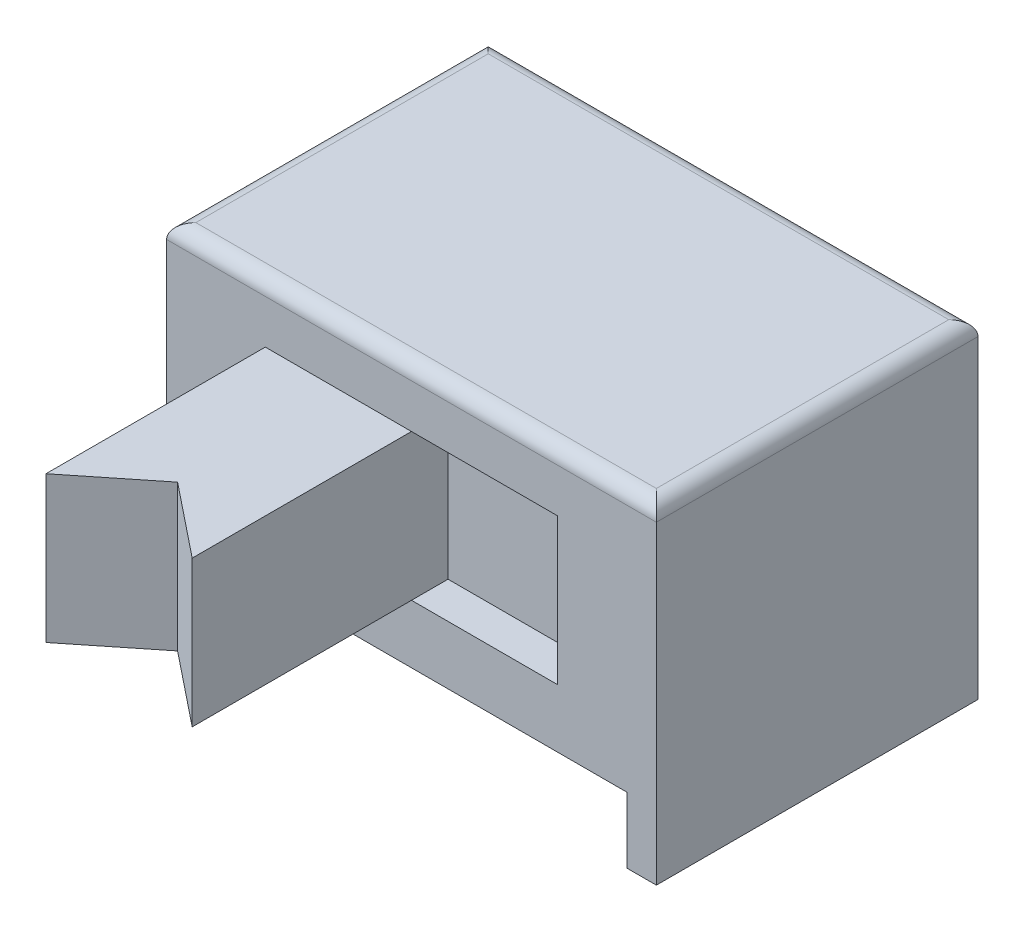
ISO-10303-21;
HEADER;
FILE_DESCRIPTION(('STEP AP214'),'2;1');
FILE_NAME('part.step','',(''),(''),'','','');
FILE_SCHEMA(('AUTOMOTIVE_DESIGN { 1 0 10303 214 1 1 1 1 }'));
ENDSEC;
DATA;
#1=APPLICATION_CONTEXT('core data for automotive mechanical design processes');
#2=APPLICATION_PROTOCOL_DEFINITION('international standard','automotive_design',2000,#1);
#3=PRODUCT_CONTEXT('',#1,'mechanical');
#4=PRODUCT('Part','Part','',(#3));
#5=PRODUCT_RELATED_PRODUCT_CATEGORY('part','',(#4));
#6=PRODUCT_DEFINITION_FORMATION('','',#4);
#7=PRODUCT_DEFINITION_CONTEXT('part definition',#1,'design');
#8=PRODUCT_DEFINITION('design','',#6,#7);
#9=PRODUCT_DEFINITION_SHAPE('','',#8);
#10=(LENGTH_UNIT() NAMED_UNIT(*) SI_UNIT(.MILLI.,.METRE.));
#11=(NAMED_UNIT(*) PLANE_ANGLE_UNIT() SI_UNIT($,.RADIAN.));
#12=(NAMED_UNIT(*) SI_UNIT($,.STERADIAN.) SOLID_ANGLE_UNIT());
#13=UNCERTAINTY_MEASURE_WITH_UNIT(LENGTH_MEASURE(1.E-05),#10,'distance_accuracy_value','');
#14=(GEOMETRIC_REPRESENTATION_CONTEXT(3) GLOBAL_UNCERTAINTY_ASSIGNED_CONTEXT((#13)) GLOBAL_UNIT_ASSIGNED_CONTEXT((#10,
#11,#12)) REPRESENTATION_CONTEXT('',''));
#15=CARTESIAN_POINT('',(0.,0.,0.));
#16=DIRECTION('',(0.,0.,1.));
#17=DIRECTION('',(1.,0.,0.));
#18=AXIS2_PLACEMENT_3D('',#15,#16,#17);
#19=CARTESIAN_POINT('',(0.,0.,-4.4));
#20=DIRECTION('',(0.,-1.,0.));
#21=DIRECTION('',(0.,0.,-1.));
#22=AXIS2_PLACEMENT_3D('',#19,#20,#21);
#23=PLANE('',#22);
#24=DIRECTION('',(0.,0.,1.));
#25=VECTOR('',#24,1.);
#26=CARTESIAN_POINT('',(0.4,0.,-4.4));
#27=LINE('',#26,#25);
#28=CARTESIAN_POINT('',(0.4,0.,-4.4));
#29=VERTEX_POINT('',#28);
#30=CARTESIAN_POINT('',(0.4,0.,0.));
#31=VERTEX_POINT('',#30);
#32=EDGE_CURVE('E155',#29,#31,#27,.T.);
#33=ORIENTED_EDGE('',*,*,#32,.T.);
#34=DIRECTION('',(1.,0.,0.));
#35=VECTOR('',#34,1.);
#36=CARTESIAN_POINT('',(0.,0.,0.));
#37=LINE('',#36,#35);
#38=CARTESIAN_POINT('',(0.,0.,0.));
#39=VERTEX_POINT('',#38);
#40=EDGE_CURVE('E168',#39,#31,#37,.T.);
#41=ORIENTED_EDGE('',*,*,#40,.F.);
#42=DIRECTION('',(0.,0.,1.));
#43=VECTOR('',#42,1.);
#44=CARTESIAN_POINT('',(0.,0.,0.));
#45=LINE('',#44,#43);
#46=CARTESIAN_POINT('',(0.,0.,-4.4));
#47=VERTEX_POINT('',#46);
#48=EDGE_CURVE('E181',#47,#39,#45,.T.);
#49=ORIENTED_EDGE('',*,*,#48,.F.);
#50=DIRECTION('',(-1.,0.,0.));
#51=VECTOR('',#50,1.);
#52=CARTESIAN_POINT('',(0.,0.,-4.4));
#53=LINE('',#52,#51);
#54=EDGE_CURVE('E170',#29,#47,#53,.T.);
#55=ORIENTED_EDGE('',*,*,#54,.F.);
#56=EDGE_LOOP('',(#33,#41,#49,#55));
#57=FACE_BOUND('',#56,.T.);
#58=ADVANCED_FACE('F26',(#57),#23,.T.);
#59=CARTESIAN_POINT('',(1.35,3.7,-0.5));
#60=DIRECTION('',(0.,1.,0.));
#61=DIRECTION('',(-1.,0.,0.));
#62=AXIS2_PLACEMENT_3D('',#59,#60,#61);
#63=PLANE('',#62);
#64=DIRECTION('',(0.,0.,-1.));
#65=VECTOR('',#64,1.);
#66=CARTESIAN_POINT('',(3.35,3.7,3.));
#67=LINE('',#66,#65);
#68=CARTESIAN_POINT('',(3.35,3.7,0.));
#69=VERTEX_POINT('',#68);
#70=CARTESIAN_POINT('',(3.35,3.7,-0.5));
#71=VERTEX_POINT('',#70);
#72=EDGE_CURVE('E265',#69,#71,#67,.T.);
#73=ORIENTED_EDGE('',*,*,#72,.T.);
#74=DIRECTION('',(-1.,0.,0.));
#75=VECTOR('',#74,1.);
#76=CARTESIAN_POINT('',(1.35,3.7,-0.5));
#77=LINE('',#76,#75);
#78=CARTESIAN_POINT('',(5.35,3.7,-0.5));
#79=VERTEX_POINT('',#78);
#80=EDGE_CURVE('E294',#79,#71,#77,.T.);
#81=ORIENTED_EDGE('',*,*,#80,.F.);
#82=DIRECTION('',(0.,0.,1.));
#83=VECTOR('',#82,1.);
#84=CARTESIAN_POINT('',(5.35,3.7,-0.5));
#85=LINE('',#84,#83);
#86=CARTESIAN_POINT('',(5.35,3.7,0.));
#87=VERTEX_POINT('',#86);
#88=EDGE_CURVE('E298',#79,#87,#85,.T.);
#89=ORIENTED_EDGE('',*,*,#88,.T.);
#90=DIRECTION('',(-1.,0.,0.));
#91=VECTOR('',#90,1.);
#92=CARTESIAN_POINT('',(1.35,3.7,0.));
#93=LINE('',#92,#91);
#94=EDGE_CURVE('E286',#87,#69,#93,.T.);
#95=ORIENTED_EDGE('',*,*,#94,.T.);
#96=EDGE_LOOP('',(#73,#81,#89,#95));
#97=FACE_BOUND('',#96,.T.);
#98=ADVANCED_FACE('F315',(#97),#63,.F.);
#99=CARTESIAN_POINT('',(1.35,1.7,-0.5));
#100=DIRECTION('',(0.,-1.,0.));
#101=DIRECTION('',(1.,0.,0.));
#102=AXIS2_PLACEMENT_3D('',#99,#100,#101);
#103=PLANE('',#102);
#104=DIRECTION('',(0.,0.,-1.));
#105=VECTOR('',#104,1.);
#106=CARTESIAN_POINT('',(3.35,1.7,3.));
#107=LINE('',#106,#105);
#108=CARTESIAN_POINT('',(3.35,1.7,0.));
#109=VERTEX_POINT('',#108);
#110=CARTESIAN_POINT('',(3.35,1.7,-0.5));
#111=VERTEX_POINT('',#110);
#112=EDGE_CURVE('E269',#109,#111,#107,.T.);
#113=ORIENTED_EDGE('',*,*,#112,.F.);
#114=DIRECTION('',(1.,0.,0.));
#115=VECTOR('',#114,1.);
#116=CARTESIAN_POINT('',(1.35,1.7,0.));
#117=LINE('',#116,#115);
#118=CARTESIAN_POINT('',(5.35,1.7,0.));
#119=VERTEX_POINT('',#118);
#120=EDGE_CURVE('E280',#109,#119,#117,.T.);
#121=ORIENTED_EDGE('',*,*,#120,.T.);
#122=DIRECTION('',(0.,0.,1.));
#123=VECTOR('',#122,1.);
#124=CARTESIAN_POINT('',(5.35,1.7,-0.5));
#125=LINE('',#124,#123);
#126=CARTESIAN_POINT('',(5.35,1.7,-0.5));
#127=VERTEX_POINT('',#126);
#128=EDGE_CURVE('E297',#127,#119,#125,.T.);
#129=ORIENTED_EDGE('',*,*,#128,.F.);
#130=DIRECTION('',(1.,0.,0.));
#131=VECTOR('',#130,1.);
#132=CARTESIAN_POINT('',(1.35,1.7,-0.5));
#133=LINE('',#132,#131);
#134=EDGE_CURVE('E289',#111,#127,#133,.T.);
#135=ORIENTED_EDGE('',*,*,#134,.F.);
#136=EDGE_LOOP('',(#113,#121,#129,#135));
#137=FACE_BOUND('',#136,.T.);
#138=ADVANCED_FACE('F321',(#137),#103,.F.);
#139=CARTESIAN_POINT('',(1.35,3.7,-0.5));
#140=DIRECTION('',(0.,0.,1.));
#141=DIRECTION('',(1.,0.,0.));
#142=AXIS2_PLACEMENT_3D('',#139,#140,#141);
#143=PLANE('',#142);
#144=ORIENTED_EDGE('',*,*,#80,.T.);
#145=DIRECTION('',(0.,1.,0.));
#146=VECTOR('',#145,1.);
#147=CARTESIAN_POINT('',(3.35,3.7,-0.5));
#148=LINE('',#147,#146);
#149=EDGE_CURVE('E256',#111,#71,#148,.T.);
#150=ORIENTED_EDGE('',*,*,#149,.F.);
#151=ORIENTED_EDGE('',*,*,#134,.T.);
#152=DIRECTION('',(0.,1.,0.));
#153=VECTOR('',#152,1.);
#154=CARTESIAN_POINT('',(5.35,3.7,-0.5));
#155=LINE('',#154,#153);
#156=EDGE_CURVE('E291',#127,#79,#155,.T.);
#157=ORIENTED_EDGE('',*,*,#156,.T.);
#158=EDGE_LOOP('',(#144,#150,#151,#157));
#159=FACE_BOUND('',#158,.T.);
#160=ADVANCED_FACE('F318',(#159),#143,.T.);
#161=CARTESIAN_POINT('',(0.,4.5,0.));
#162=DIRECTION('',(1.,0.,0.));
#163=DIRECTION('',(0.,0.,-1.));
#164=AXIS2_PLACEMENT_3D('',#161,#162,#163);
#165=PLANE('',#164);
#166=DIRECTION('',(0.,-1.,0.));
#167=VECTOR('',#166,1.);
#168=CARTESIAN_POINT('',(0.,4.5,0.));
#169=LINE('',#168,#167);
#170=CARTESIAN_POINT('',(0.,4.3,0.));
#171=VERTEX_POINT('',#170);
#172=EDGE_CURVE('E175',#171,#39,#169,.T.);
#173=ORIENTED_EDGE('',*,*,#172,.F.);
#174=DIRECTION('',(0.,0.,1.));
#175=VECTOR('',#174,1.);
#176=CARTESIAN_POINT('',(0.,4.3,0.));
#177=LINE('',#176,#175);
#178=CARTESIAN_POINT('',(0.,4.3,-4.4));
#179=VERTEX_POINT('',#178);
#180=EDGE_CURVE('E49',#171,#179,#177,.F.);
#181=ORIENTED_EDGE('',*,*,#180,.T.);
#182=DIRECTION('',(0.,-1.,0.));
#183=VECTOR('',#182,1.);
#184=CARTESIAN_POINT('',(0.,4.5,-4.4));
#185=LINE('',#184,#183);
#186=EDGE_CURVE('E188',#179,#47,#185,.T.);
#187=ORIENTED_EDGE('',*,*,#186,.T.);
#188=ORIENTED_EDGE('',*,*,#48,.T.);
#189=EDGE_LOOP('',(#173,#181,#187,#188));
#190=FACE_BOUND('',#189,.T.);
#191=ADVANCED_FACE('F28',(#190),#165,.F.);
#192=CARTESIAN_POINT('',(0.,4.5,0.));
#193=DIRECTION('',(0.,0.,-1.));
#194=DIRECTION('',(-1.,0.,0.));
#195=AXIS2_PLACEMENT_3D('',#192,#193,#194);
#196=PLANE('',#195);
#197=CARTESIAN_POINT('',(1.35,1.7,0.));
#198=VERTEX_POINT('',#197);
#199=EDGE_CURVE('E281',#198,#109,#117,.T.);
#200=ORIENTED_EDGE('',*,*,#199,.F.);
#201=DIRECTION('',(0.,-1.,0.));
#202=VECTOR('',#201,1.);
#203=CARTESIAN_POINT('',(1.35,3.7,0.));
#204=LINE('',#203,#202);
#205=CARTESIAN_POINT('',(1.35,3.7,0.));
#206=VERTEX_POINT('',#205);
#207=EDGE_CURVE('E278',#206,#198,#204,.T.);
#208=ORIENTED_EDGE('',*,*,#207,.F.);
#209=DIRECTION('',(-1.,0.,0.));
#210=VECTOR('',#209,1.);
#211=CARTESIAN_POINT('',(0.,3.7,0.));
#212=LINE('',#211,#210);
#213=EDGE_CURVE('E276',#69,#206,#212,.T.);
#214=ORIENTED_EDGE('',*,*,#213,.F.);
#215=ORIENTED_EDGE('',*,*,#94,.F.);
#216=DIRECTION('',(0.,1.,0.));
#217=VECTOR('',#216,1.);
#218=CARTESIAN_POINT('',(5.35,3.7,0.));
#219=LINE('',#218,#217);
#220=EDGE_CURVE('E283',#119,#87,#219,.T.);
#221=ORIENTED_EDGE('',*,*,#220,.F.);
#222=ORIENTED_EDGE('',*,*,#120,.F.);
#223=EDGE_LOOP('',(#200,#208,#214,#215,#221,#222));
#224=FACE_BOUND('',#223,.T.);
#225=ORIENTED_EDGE('',*,*,#40,.T.);
#226=DIRECTION('',(0.,-1.,0.));
#227=VECTOR('',#226,1.);
#228=CARTESIAN_POINT('',(0.4,0.,0.));
#229=LINE('',#228,#227);
#230=CARTESIAN_POINT('',(0.4,0.9,0.));
#231=VERTEX_POINT('',#230);
#232=EDGE_CURVE('E151',#231,#31,#229,.T.);
#233=ORIENTED_EDGE('',*,*,#232,.F.);
#234=DIRECTION('',(-1.,0.,0.));
#235=VECTOR('',#234,1.);
#236=CARTESIAN_POINT('',(0.4,0.9,0.));
#237=LINE('',#236,#235);
#238=CARTESIAN_POINT('',(6.3,0.9,0.));
#239=VERTEX_POINT('',#238);
#240=EDGE_CURVE('E382',#239,#231,#237,.T.);
#241=ORIENTED_EDGE('',*,*,#240,.F.);
#242=DIRECTION('',(0.,1.,0.));
#243=VECTOR('',#242,1.);
#244=CARTESIAN_POINT('',(6.3,0.,0.));
#245=LINE('',#244,#243);
#246=CARTESIAN_POINT('',(6.3,0.,0.));
#247=VERTEX_POINT('',#246);
#248=EDGE_CURVE('E162',#247,#239,#245,.T.);
#249=ORIENTED_EDGE('',*,*,#248,.F.);
#250=CARTESIAN_POINT('',(6.7,0.,0.));
#251=VERTEX_POINT('',#250);
#252=EDGE_CURVE('E177',#247,#251,#37,.T.);
#253=ORIENTED_EDGE('',*,*,#252,.T.);
#254=DIRECTION('',(0.,-1.,0.));
#255=VECTOR('',#254,1.);
#256=CARTESIAN_POINT('',(6.7,4.5,0.));
#257=LINE('',#256,#255);
#258=CARTESIAN_POINT('',(6.7,4.3,0.));
#259=VERTEX_POINT('',#258);
#260=EDGE_CURVE('E192',#259,#251,#257,.T.);
#261=ORIENTED_EDGE('',*,*,#260,.F.);
#262=DIRECTION('',(1.,0.,0.));
#263=VECTOR('',#262,1.);
#264=CARTESIAN_POINT('',(0.,4.3,0.));
#265=LINE('',#264,#263);
#266=EDGE_CURVE('E11',#259,#171,#265,.F.);
#267=ORIENTED_EDGE('',*,*,#266,.T.);
#268=ORIENTED_EDGE('',*,*,#172,.T.);
#269=EDGE_LOOP('',(#225,#233,#241,#249,#253,#261,#267,#268));
#270=FACE_BOUND('',#269,.T.);
#271=ADVANCED_FACE('F174',(#224,#270),#196,.F.);
#272=CARTESIAN_POINT('',(6.7,4.5,0.));
#273=DIRECTION('',(-1.,0.,0.));
#274=DIRECTION('',(0.,0.,1.));
#275=AXIS2_PLACEMENT_3D('',#272,#273,#274);
#276=PLANE('',#275);
#277=DIRECTION('',(0.,-1.,0.));
#278=VECTOR('',#277,1.);
#279=CARTESIAN_POINT('',(6.7,4.5,-4.4));
#280=LINE('',#279,#278);
#281=CARTESIAN_POINT('',(6.7,4.3,-4.4));
#282=VERTEX_POINT('',#281);
#283=CARTESIAN_POINT('',(6.7,0.,-4.4));
#284=VERTEX_POINT('',#283);
#285=EDGE_CURVE('E190',#282,#284,#280,.T.);
#286=ORIENTED_EDGE('',*,*,#285,.F.);
#287=DIRECTION('',(0.,0.,-1.));
#288=VECTOR('',#287,1.);
#289=CARTESIAN_POINT('',(6.7,4.3,0.));
#290=LINE('',#289,#288);
#291=EDGE_CURVE('E205',#282,#259,#290,.F.);
#292=ORIENTED_EDGE('',*,*,#291,.T.);
#293=ORIENTED_EDGE('',*,*,#260,.T.);
#294=DIRECTION('',(0.,0.,-1.));
#295=VECTOR('',#294,1.);
#296=CARTESIAN_POINT('',(6.7,0.,0.));
#297=LINE('',#296,#295);
#298=EDGE_CURVE('E176',#251,#284,#297,.T.);
#299=ORIENTED_EDGE('',*,*,#298,.T.);
#300=EDGE_LOOP('',(#286,#292,#293,#299));
#301=FACE_BOUND('',#300,.T.);
#302=ADVANCED_FACE('F219',(#301),#276,.F.);
#303=CARTESIAN_POINT('',(0.,4.5,-4.4));
#304=DIRECTION('',(0.,0.,1.));
#305=DIRECTION('',(1.,0.,0.));
#306=AXIS2_PLACEMENT_3D('',#303,#304,#305);
#307=PLANE('',#306);
#308=DIRECTION('',(-1.,0.,0.));
#309=VECTOR('',#308,1.);
#310=CARTESIAN_POINT('',(0.4,0.9,-4.4));
#311=LINE('',#310,#309);
#312=CARTESIAN_POINT('',(6.3,0.9,-4.4));
#313=VERTEX_POINT('',#312);
#314=CARTESIAN_POINT('',(0.4,0.9,-4.4));
#315=VERTEX_POINT('',#314);
#316=EDGE_CURVE('E172',#313,#315,#311,.T.);
#317=ORIENTED_EDGE('',*,*,#316,.T.);
#318=DIRECTION('',(0.,-1.,0.));
#319=VECTOR('',#318,1.);
#320=CARTESIAN_POINT('',(0.4,0.,-4.4));
#321=LINE('',#320,#319);
#322=EDGE_CURVE('E379',#315,#29,#321,.T.);
#323=ORIENTED_EDGE('',*,*,#322,.T.);
#324=ORIENTED_EDGE('',*,*,#54,.T.);
#325=ORIENTED_EDGE('',*,*,#186,.F.);
#326=DIRECTION('',(-1.,0.,0.));
#327=VECTOR('',#326,1.);
#328=CARTESIAN_POINT('',(0.,4.3,-4.4));
#329=LINE('',#328,#327);
#330=EDGE_CURVE('E34',#179,#282,#329,.F.);
#331=ORIENTED_EDGE('',*,*,#330,.T.);
#332=ORIENTED_EDGE('',*,*,#285,.T.);
#333=CARTESIAN_POINT('',(6.3,0.,-4.4));
#334=VERTEX_POINT('',#333);
#335=EDGE_CURVE('E185',#284,#334,#53,.T.);
#336=ORIENTED_EDGE('',*,*,#335,.T.);
#337=DIRECTION('',(0.,1.,0.));
#338=VECTOR('',#337,1.);
#339=CARTESIAN_POINT('',(6.3,0.,-4.4));
#340=LINE('',#339,#338);
#341=EDGE_CURVE('E41',#334,#313,#340,.T.);
#342=ORIENTED_EDGE('',*,*,#341,.T.);
#343=EDGE_LOOP('',(#317,#323,#324,#325,#331,#332,#336,#342));
#344=FACE_BOUND('',#343,.T.);
#345=ADVANCED_FACE('F212',(#344),#307,.F.);
#346=CARTESIAN_POINT('',(0.,4.5,-4.4));
#347=DIRECTION('',(0.,-1.,0.));
#348=DIRECTION('',(0.,0.,-1.));
#349=AXIS2_PLACEMENT_3D('',#346,#347,#348);
#350=PLANE('',#349);
#351=DIRECTION('',(0.,0.,-1.));
#352=VECTOR('',#351,1.);
#353=CARTESIAN_POINT('',(6.5,4.5,-4.4));
#354=LINE('',#353,#352);
#355=CARTESIAN_POINT('',(6.5,4.5,-0.2));
#356=VERTEX_POINT('',#355);
#357=CARTESIAN_POINT('',(6.5,4.5,-4.2));
#358=VERTEX_POINT('',#357);
#359=EDGE_CURVE('E200',#356,#358,#354,.T.);
#360=ORIENTED_EDGE('',*,*,#359,.T.);
#361=DIRECTION('',(-1.,0.,0.));
#362=VECTOR('',#361,1.);
#363=CARTESIAN_POINT('',(0.,4.5,-4.2));
#364=LINE('',#363,#362);
#365=CARTESIAN_POINT('',(0.2,4.5,-4.2));
#366=VERTEX_POINT('',#365);
#367=EDGE_CURVE('E203',#358,#366,#364,.T.);
#368=ORIENTED_EDGE('',*,*,#367,.T.);
#369=DIRECTION('',(0.,0.,1.));
#370=VECTOR('',#369,1.);
#371=CARTESIAN_POINT('',(0.2,4.5,-4.4));
#372=LINE('',#371,#370);
#373=CARTESIAN_POINT('',(0.2,4.5,-0.2));
#374=VERTEX_POINT('',#373);
#375=EDGE_CURVE('E198',#366,#374,#372,.T.);
#376=ORIENTED_EDGE('',*,*,#375,.T.);
#377=DIRECTION('',(1.,0.,0.));
#378=VECTOR('',#377,1.);
#379=CARTESIAN_POINT('',(0.,4.5,-0.2));
#380=LINE('',#379,#378);
#381=EDGE_CURVE('E196',#374,#356,#380,.T.);
#382=ORIENTED_EDGE('',*,*,#381,.T.);
#383=EDGE_LOOP('',(#360,#368,#376,#382));
#384=FACE_BOUND('',#383,.T.);
#385=ADVANCED_FACE('F365',(#384),#350,.F.);
#386=DIRECTION('',(0.,0.,1.));
#387=VECTOR('',#386,1.);
#388=CARTESIAN_POINT('',(6.3,0.,-4.4));
#389=LINE('',#388,#387);
#390=EDGE_CURVE('E171',#334,#247,#389,.T.);
#391=ORIENTED_EDGE('',*,*,#390,.F.);
#392=ORIENTED_EDGE('',*,*,#335,.F.);
#393=ORIENTED_EDGE('',*,*,#298,.F.);
#394=ORIENTED_EDGE('',*,*,#252,.F.);
#395=EDGE_LOOP('',(#391,#392,#393,#394));
#396=FACE_BOUND('',#395,.T.);
#397=ADVANCED_FACE('F355',(#396),#23,.T.);
#398=CARTESIAN_POINT('',(5.35,3.7,-0.5));
#399=DIRECTION('',(1.,0.,0.));
#400=DIRECTION('',(0.,1.,0.));
#401=AXIS2_PLACEMENT_3D('',#398,#399,#400);
#402=PLANE('',#401);
#403=ORIENTED_EDGE('',*,*,#220,.T.);
#404=ORIENTED_EDGE('',*,*,#88,.F.);
#405=ORIENTED_EDGE('',*,*,#156,.F.);
#406=ORIENTED_EDGE('',*,*,#128,.T.);
#407=EDGE_LOOP('',(#403,#404,#405,#406));
#408=FACE_BOUND('',#407,.T.);
#409=ADVANCED_FACE('F304',(#408),#402,.F.);
#410=CARTESIAN_POINT('',(1.35,3.7,3.));
#411=DIRECTION('',(1.,0.,0.));
#412=DIRECTION('',(0.,0.,-1.));
#413=AXIS2_PLACEMENT_3D('',#410,#411,#412);
#414=PLANE('',#413);
#415=DIRECTION('',(0.,0.,-1.));
#416=VECTOR('',#415,1.);
#417=CARTESIAN_POINT('',(1.35,3.7,3.));
#418=LINE('',#417,#416);
#419=CARTESIAN_POINT('',(1.35,3.7,3.));
#420=VERTEX_POINT('',#419);
#421=EDGE_CURVE('E262',#420,#206,#418,.T.);
#422=ORIENTED_EDGE('',*,*,#421,.T.);
#423=ORIENTED_EDGE('',*,*,#207,.T.);
#424=DIRECTION('',(0.,0.,-1.));
#425=VECTOR('',#424,1.);
#426=CARTESIAN_POINT('',(1.35,1.7,3.));
#427=LINE('',#426,#425);
#428=CARTESIAN_POINT('',(1.35,1.7,3.));
#429=VERTEX_POINT('',#428);
#430=EDGE_CURVE('E273',#429,#198,#427,.T.);
#431=ORIENTED_EDGE('',*,*,#430,.F.);
#432=DIRECTION('',(0.,-1.,0.));
#433=VECTOR('',#432,1.);
#434=CARTESIAN_POINT('',(1.35,3.7,3.));
#435=LINE('',#434,#433);
#436=EDGE_CURVE('E258',#420,#429,#435,.T.);
#437=ORIENTED_EDGE('',*,*,#436,.F.);
#438=EDGE_LOOP('',(#422,#423,#431,#437));
#439=FACE_BOUND('',#438,.T.);
#440=ADVANCED_FACE('F333',(#439),#414,.F.);
#441=CARTESIAN_POINT('',(1.35,1.7,3.));
#442=DIRECTION('',(0.,1.,0.));
#443=DIRECTION('',(0.,0.,1.));
#444=AXIS2_PLACEMENT_3D('',#441,#442,#443);
#445=PLANE('',#444);
#446=DIRECTION('',(0.78086880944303,0.,0.624695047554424));
#447=VECTOR('',#446,1.);
#448=CARTESIAN_POINT('',(2.35,1.7,2.2));
#449=LINE('',#448,#447);
#450=CARTESIAN_POINT('',(2.35,1.7,2.2));
#451=VERTEX_POINT('',#450);
#452=CARTESIAN_POINT('',(3.35,1.7,3.));
#453=VERTEX_POINT('',#452);
#454=EDGE_CURVE('E246',#451,#453,#449,.T.);
#455=ORIENTED_EDGE('',*,*,#454,.F.);
#456=DIRECTION('',(0.78086880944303,0.,-0.624695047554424));
#457=VECTOR('',#456,1.);
#458=CARTESIAN_POINT('',(1.35,1.7,3.));
#459=LINE('',#458,#457);
#460=EDGE_CURVE('E243',#429,#451,#459,.T.);
#461=ORIENTED_EDGE('',*,*,#460,.F.);
#462=ORIENTED_EDGE('',*,*,#430,.T.);
#463=ORIENTED_EDGE('',*,*,#199,.T.);
#464=EDGE_CURVE('E270',#453,#109,#107,.T.);
#465=ORIENTED_EDGE('',*,*,#464,.F.);
#466=EDGE_LOOP('',(#455,#461,#462,#463,#465));
#467=FACE_BOUND('',#466,.T.);
#468=ADVANCED_FACE('F329',(#467),#445,.F.);
#469=CARTESIAN_POINT('',(1.35,3.7,3.));
#470=DIRECTION('',(0.,-1.,0.));
#471=DIRECTION('',(1.,0.,0.));
#472=AXIS2_PLACEMENT_3D('',#469,#470,#471);
#473=PLANE('',#472);
#474=ORIENTED_EDGE('',*,*,#421,.F.);
#475=DIRECTION('',(0.78086880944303,0.,-0.624695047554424));
#476=VECTOR('',#475,1.);
#477=CARTESIAN_POINT('',(1.35,3.7,3.));
#478=LINE('',#477,#476);
#479=CARTESIAN_POINT('',(2.35,3.7,2.2));
#480=VERTEX_POINT('',#479);
#481=EDGE_CURVE('E253',#420,#480,#478,.T.);
#482=ORIENTED_EDGE('',*,*,#481,.T.);
#483=DIRECTION('',(0.78086880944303,0.,0.624695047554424));
#484=VECTOR('',#483,1.);
#485=CARTESIAN_POINT('',(2.13048780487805,3.7,2.02439024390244));
#486=LINE('',#485,#484);
#487=CARTESIAN_POINT('',(3.35,3.7,3.));
#488=VERTEX_POINT('',#487);
#489=EDGE_CURVE('E250',#480,#488,#486,.T.);
#490=ORIENTED_EDGE('',*,*,#489,.T.);
#491=EDGE_CURVE('E266',#488,#69,#67,.T.);
#492=ORIENTED_EDGE('',*,*,#491,.T.);
#493=ORIENTED_EDGE('',*,*,#213,.T.);
#494=EDGE_LOOP('',(#474,#482,#490,#492,#493));
#495=FACE_BOUND('',#494,.T.);
#496=ADVANCED_FACE('F337',(#495),#473,.F.);
#497=CARTESIAN_POINT('',(3.35,3.7,3.));
#498=DIRECTION('',(-1.,0.,0.));
#499=DIRECTION('',(0.,0.,1.));
#500=AXIS2_PLACEMENT_3D('',#497,#498,#499);
#501=PLANE('',#500);
#502=ORIENTED_EDGE('',*,*,#149,.T.);
#503=ORIENTED_EDGE('',*,*,#72,.F.);
#504=ORIENTED_EDGE('',*,*,#491,.F.);
#505=DIRECTION('',(0.,1.,0.));
#506=VECTOR('',#505,1.);
#507=CARTESIAN_POINT('',(3.35,3.7,3.));
#508=LINE('',#507,#506);
#509=EDGE_CURVE('E260',#453,#488,#508,.T.);
#510=ORIENTED_EDGE('',*,*,#509,.F.);
#511=ORIENTED_EDGE('',*,*,#464,.T.);
#512=ORIENTED_EDGE('',*,*,#112,.T.);
#513=EDGE_LOOP('',(#502,#503,#504,#510,#511,#512));
#514=FACE_BOUND('',#513,.T.);
#515=ADVANCED_FACE('F323',(#514),#501,.F.);
#516=CARTESIAN_POINT('',(1.35,4.5,3.));
#517=DIRECTION('',(-0.624695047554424,0.,-0.78086880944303));
#518=DIRECTION('',(-0.78086880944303,0.,0.624695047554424));
#519=AXIS2_PLACEMENT_3D('',#516,#517,#518);
#520=PLANE('',#519);
#521=ORIENTED_EDGE('',*,*,#436,.T.);
#522=ORIENTED_EDGE('',*,*,#460,.T.);
#523=DIRECTION('',(0.,-1.,0.));
#524=VECTOR('',#523,1.);
#525=CARTESIAN_POINT('',(2.35,4.5,2.2));
#526=LINE('',#525,#524);
#527=EDGE_CURVE('E248',#480,#451,#526,.T.);
#528=ORIENTED_EDGE('',*,*,#527,.F.);
#529=ORIENTED_EDGE('',*,*,#481,.F.);
#530=EDGE_LOOP('',(#521,#522,#528,#529));
#531=FACE_BOUND('',#530,.T.);
#532=ADVANCED_FACE('F342',(#531),#520,.F.);
#533=CARTESIAN_POINT('',(2.35,4.5,2.2));
#534=DIRECTION('',(0.624695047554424,0.,-0.78086880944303));
#535=DIRECTION('',(-0.78086880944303,0.,-0.624695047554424));
#536=AXIS2_PLACEMENT_3D('',#533,#534,#535);
#537=PLANE('',#536);
#538=ORIENTED_EDGE('',*,*,#527,.T.);
#539=ORIENTED_EDGE('',*,*,#454,.T.);
#540=ORIENTED_EDGE('',*,*,#509,.T.);
#541=ORIENTED_EDGE('',*,*,#489,.F.);
#542=EDGE_LOOP('',(#538,#539,#540,#541));
#543=FACE_BOUND('',#542,.T.);
#544=ADVANCED_FACE('F340',(#543),#537,.F.);
#545=CARTESIAN_POINT('',(0.2,4.3,-4.4));
#546=DIRECTION('',(0.,0.,1.));
#547=DIRECTION('',(1.,0.,0.));
#548=AXIS2_PLACEMENT_3D('',#545,#546,#547);
#549=CYLINDRICAL_SURFACE('',#548,0.2);
#550=CARTESIAN_POINT('',(0.2,4.3,-4.2));
#551=DIRECTION('',(-0.707106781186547,0.,0.707106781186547));
#552=DIRECTION('',(-0.707106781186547,0.,-0.707106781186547));
#553=AXIS2_PLACEMENT_3D('',#550,#551,#552);
#554=ELLIPSE('',#553,0.282842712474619,0.2);
#555=EDGE_CURVE('E233',#179,#366,#554,.F.);
#556=ORIENTED_EDGE('',*,*,#555,.F.);
#557=ORIENTED_EDGE('',*,*,#180,.F.);
#558=CARTESIAN_POINT('',(0.2,4.3,-0.2));
#559=DIRECTION('',(0.707106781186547,0.,0.707106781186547));
#560=DIRECTION('',(0.707106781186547,0.,-0.707106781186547));
#561=AXIS2_PLACEMENT_3D('',#558,#559,#560);
#562=ELLIPSE('',#561,0.282842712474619,0.2);
#563=EDGE_CURVE('E240',#374,#171,#562,.T.);
#564=ORIENTED_EDGE('',*,*,#563,.F.);
#565=ORIENTED_EDGE('',*,*,#375,.F.);
#566=EDGE_LOOP('',(#556,#557,#564,#565));
#567=FACE_BOUND('',#566,.T.);
#568=ADVANCED_FACE('F349',(#567),#549,.T.);
#569=CARTESIAN_POINT('',(0.,4.3,-0.2));
#570=DIRECTION('',(1.,0.,0.));
#571=DIRECTION('',(0.,0.,-1.));
#572=AXIS2_PLACEMENT_3D('',#569,#570,#571);
#573=CYLINDRICAL_SURFACE('',#572,0.2);
#574=ORIENTED_EDGE('',*,*,#563,.T.);
#575=ORIENTED_EDGE('',*,*,#266,.F.);
#576=CARTESIAN_POINT('',(6.5,4.3,-0.2));
#577=DIRECTION('',(0.707106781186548,0.,-0.707106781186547));
#578=DIRECTION('',(0.707106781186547,0.,0.707106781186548));
#579=AXIS2_PLACEMENT_3D('',#576,#577,#578);
#580=ELLIPSE('',#579,0.282842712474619,0.2);
#581=EDGE_CURVE('E229',#356,#259,#580,.T.);
#582=ORIENTED_EDGE('',*,*,#581,.F.);
#583=ORIENTED_EDGE('',*,*,#381,.F.);
#584=EDGE_LOOP('',(#574,#575,#582,#583));
#585=FACE_BOUND('',#584,.T.);
#586=ADVANCED_FACE('F395',(#585),#573,.T.);
#587=CARTESIAN_POINT('',(0.,4.3,-4.2));
#588=DIRECTION('',(-1.,0.,0.));
#589=DIRECTION('',(0.,0.,1.));
#590=AXIS2_PLACEMENT_3D('',#587,#588,#589);
#591=CYLINDRICAL_SURFACE('',#590,0.2);
#592=ORIENTED_EDGE('',*,*,#555,.T.);
#593=ORIENTED_EDGE('',*,*,#367,.F.);
#594=CARTESIAN_POINT('',(6.5,4.3,-4.2));
#595=DIRECTION('',(-0.707106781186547,0.,-0.707106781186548));
#596=DIRECTION('',(-0.707106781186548,0.,0.707106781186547));
#597=AXIS2_PLACEMENT_3D('',#594,#595,#596);
#598=ELLIPSE('',#597,0.282842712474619,0.2);
#599=EDGE_CURVE('E226',#282,#358,#598,.F.);
#600=ORIENTED_EDGE('',*,*,#599,.F.);
#601=ORIENTED_EDGE('',*,*,#330,.F.);
#602=EDGE_LOOP('',(#592,#593,#600,#601));
#603=FACE_BOUND('',#602,.T.);
#604=ADVANCED_FACE('F231',(#603),#591,.T.);
#605=CARTESIAN_POINT('',(6.5,4.3,-4.4));
#606=DIRECTION('',(0.,0.,-1.));
#607=DIRECTION('',(-1.,0.,0.));
#608=AXIS2_PLACEMENT_3D('',#605,#606,#607);
#609=CYLINDRICAL_SURFACE('',#608,0.2);
#610=ORIENTED_EDGE('',*,*,#581,.T.);
#611=ORIENTED_EDGE('',*,*,#291,.F.);
#612=ORIENTED_EDGE('',*,*,#599,.T.);
#613=ORIENTED_EDGE('',*,*,#359,.F.);
#614=EDGE_LOOP('',(#610,#611,#612,#613));
#615=FACE_BOUND('',#614,.T.);
#616=ADVANCED_FACE('F224',(#615),#609,.T.);
#617=CARTESIAN_POINT('',(0.4,0.,-4.4));
#618=DIRECTION('',(-1.,0.,0.));
#619=DIRECTION('',(0.,0.,1.));
#620=AXIS2_PLACEMENT_3D('',#617,#618,#619);
#621=PLANE('',#620);
#622=ORIENTED_EDGE('',*,*,#232,.T.);
#623=ORIENTED_EDGE('',*,*,#32,.F.);
#624=ORIENTED_EDGE('',*,*,#322,.F.);
#625=DIRECTION('',(0.,0.,1.));
#626=VECTOR('',#625,1.);
#627=CARTESIAN_POINT('',(0.4,0.9,-4.4));
#628=LINE('',#627,#626);
#629=EDGE_CURVE('E157',#315,#231,#628,.T.);
#630=ORIENTED_EDGE('',*,*,#629,.T.);
#631=EDGE_LOOP('',(#622,#623,#624,#630));
#632=FACE_BOUND('',#631,.T.);
#633=ADVANCED_FACE('F153',(#632),#621,.F.);
#634=CARTESIAN_POINT('',(0.4,0.9,-4.4));
#635=DIRECTION('',(0.,1.,0.));
#636=DIRECTION('',(0.,0.,1.));
#637=AXIS2_PLACEMENT_3D('',#634,#635,#636);
#638=PLANE('',#637);
#639=ORIENTED_EDGE('',*,*,#240,.T.);
#640=ORIENTED_EDGE('',*,*,#629,.F.);
#641=ORIENTED_EDGE('',*,*,#316,.F.);
#642=DIRECTION('',(0.,0.,1.));
#643=VECTOR('',#642,1.);
#644=CARTESIAN_POINT('',(6.3,0.9,-4.4));
#645=LINE('',#644,#643);
#646=EDGE_CURVE('E235',#313,#239,#645,.T.);
#647=ORIENTED_EDGE('',*,*,#646,.T.);
#648=EDGE_LOOP('',(#639,#640,#641,#647));
#649=FACE_BOUND('',#648,.T.);
#650=ADVANCED_FACE('F387',(#649),#638,.F.);
#651=CARTESIAN_POINT('',(6.3,0.,-4.4));
#652=DIRECTION('',(1.,0.,0.));
#653=DIRECTION('',(0.,0.,-1.));
#654=AXIS2_PLACEMENT_3D('',#651,#652,#653);
#655=PLANE('',#654);
#656=ORIENTED_EDGE('',*,*,#248,.T.);
#657=ORIENTED_EDGE('',*,*,#646,.F.);
#658=ORIENTED_EDGE('',*,*,#341,.F.);
#659=ORIENTED_EDGE('',*,*,#390,.T.);
#660=EDGE_LOOP('',(#656,#657,#658,#659));
#661=FACE_BOUND('',#660,.T.);
#662=ADVANCED_FACE('F388',(#661),#655,.F.);
#663=CLOSED_SHELL('',(#58,#98,#138,#160,#191,#271,#302,#345,#385,#397,#409,#440,#468,#496,#515,
#532,#544,#568,#586,#604,#616,#633,#650,#662));
#664=MANIFOLD_SOLID_BREP('B2',#663);
#665=ADVANCED_BREP_SHAPE_REPRESENTATION('',(#18,#664),#14);
#666=SHAPE_DEFINITION_REPRESENTATION(#9,#665);
ENDSEC;
END-ISO-10303-21;
